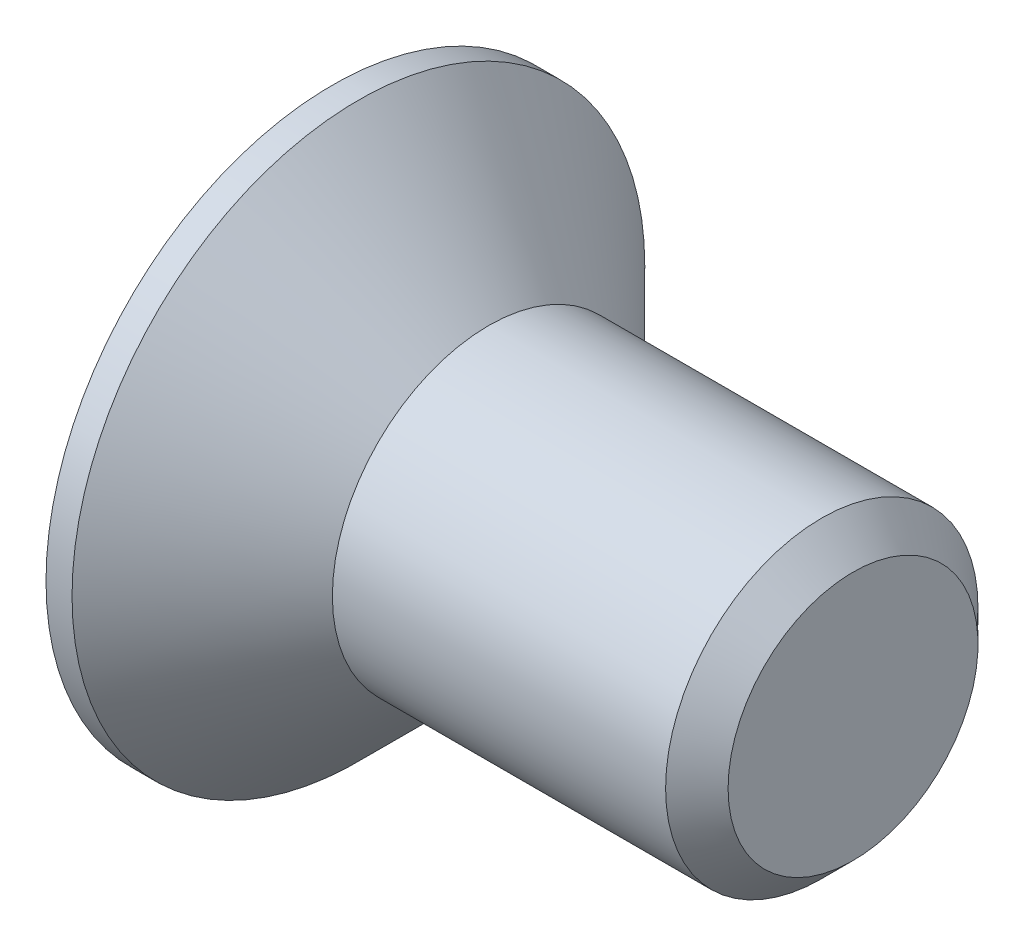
from build123d import *

# Parameters (mm, degrees)
CHAMFER1_SIZE      = 0.6
CUT_EXTRUDE1_DEPTH = 2.5


with BuildPart() as part:
    # Sketch1 → Revolve1 (revolve)
    with BuildSketch(Plane.XY, mode=Mode.PRIVATE) as revolve1_sk:
        Polygon((-3, 5.5), (-3, 0), (7, 0), (7, 3), (0, 3), (-2.5, 5.5), align=None)
    revolve(revolve1_sk.sketch.rotate(Axis((-3, 0, 0), (1, 0, 0)), 90), axis=Axis((-3, 0, 0), (1, 0, 0)))

    # Chamfer1
    chamfer1_edges = [part.edges().sort_by_distance(p)[0] for p in [
        (7, 0, -3),
    ]]
    chamfer(chamfer1_edges, length=CHAMFER1_SIZE)

    # Sketch2 → Cut-Extrude1 (cut)
    with BuildSketch(Plane.ZY.offset(3)):
        Polygon((-0.825, 3.3), (0.825, 3.3), (0.825, 0.825), (3.3, 0.825), (3.3, -0.825), (0.825, -0.825), (0.825, -3.3), (-0.825, -3.3), (-0.825, -0.825), (-3.3, -0.825), (-3.3, 0.825), (-0.825, 0.825), align=None)
    extrude(amount=-CUT_EXTRUDE1_DEPTH, mode=Mode.SUBTRACT)


solid = part.part
